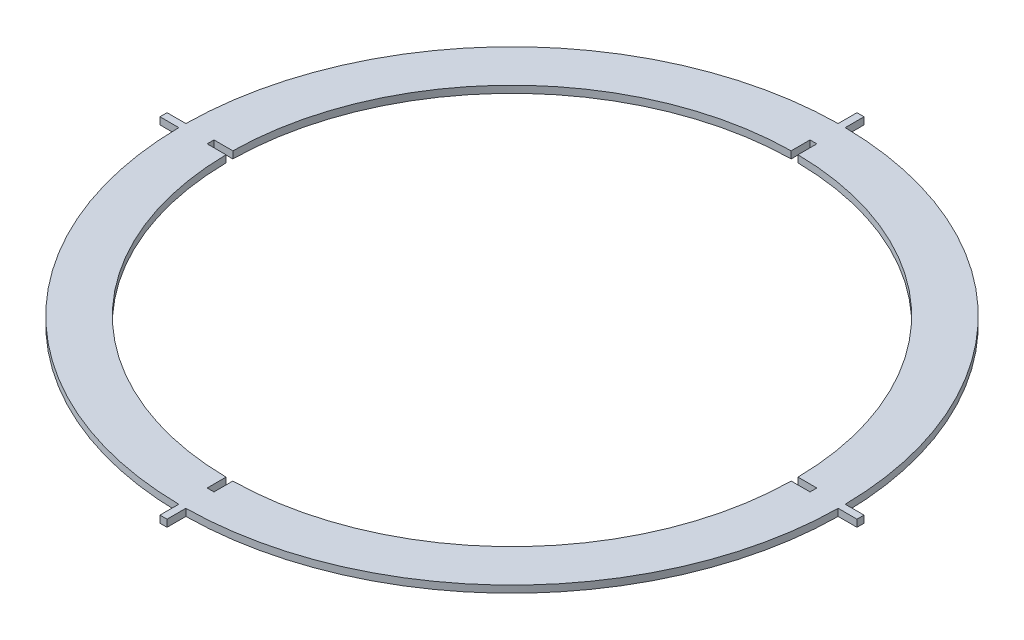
from build123d import *

# Parameters (mm, degrees)
BOSS_EXTRUDE1_DEPTH = 3


with BuildPart() as part:
    # Sketch1 → Boss-Extrude1 (new body)
    with BuildSketch(Plane(origin=(0, 0, 0), x_dir=(1, 0, 0), z_dir=(0, 1, 0))):
        with BuildLine():
            Line((-147.991964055, 1.5), (-139.991964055, 1.5))
            ThreePointArc((-139.991964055, 1.5), (-98.994949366, 98.994949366), (-1.5, 139.991964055))
            Line((-1.5, 139.991964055), (-1.5, 147.991964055))
            Line((-1.5, 147.991964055), (1.5, 147.991964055))
            Line((1.5, 147.991964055), (1.5, 139.991964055))
            ThreePointArc((1.5, 139.991964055), (98.994949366, 98.994949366), (139.991964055, 1.5))
            Line((139.991964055, 1.5), (147.991964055, 1.5))
            Line((147.991964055, 1.5), (147.991964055, -1.5))
            Line((147.991964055, -1.5), (139.991964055, -1.5))
            ThreePointArc((139.991964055, -1.5), (98.994949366, -98.994949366), (1.5, -139.991964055))
            Line((1.5, -139.991964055), (1.5, -147.991964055))
            Line((1.5, -147.991964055), (-1.5, -147.991964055))
            Line((-1.5, -147.991964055), (-1.5, -139.991964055))
            ThreePointArc((-1.5, -139.991964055), (-98.994949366, -98.994949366), (-139.991964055, -1.5))
            Line((-139.991964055, -1.5), (-147.991964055, -1.5))
            Line((-147.991964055, -1.5), (-147.991964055, 1.5))
        make_face()
        with BuildLine():
            Line((-127.991239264, -1.45), (-119.991239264, -1.45))
            ThreePointArc((-119.991239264, -1.45), (-84.852813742, -84.852813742), (-1.45, -119.991239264))
            Line((-1.45, -119.991239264), (-1.45, -127.991239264))
            Line((-1.45, -127.991239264), (1.45, -127.991239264))
            Line((1.45, -127.991239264), (1.45, -119.991239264))
            ThreePointArc((1.45, -119.991239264), (84.852813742, -84.852813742), (119.991239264, -1.45))
            Line((119.991239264, -1.45), (127.991239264, -1.45))
            Line((127.991239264, -1.45), (127.991239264, 1.45))
            Line((127.991239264, 1.45), (119.991239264, 1.45))
            ThreePointArc((119.991239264, 1.45), (84.852813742, 84.852813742), (1.45, 119.991239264))
            Line((1.45, 119.991239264), (1.45, 127.991239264))
            Line((1.45, 127.991239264), (-1.45, 127.991239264))
            Line((-1.45, 127.991239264), (-1.45, 119.991239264))
            ThreePointArc((-1.45, 119.991239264), (-84.852813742, 84.852813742), (-119.991239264, 1.45))
            Line((-119.991239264, 1.45), (-127.991239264, 1.45))
            Line((-127.991239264, 1.45), (-127.991239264, -1.45))
        make_face(mode=Mode.SUBTRACT)
    extrude(amount=BOSS_EXTRUDE1_DEPTH)


solid = part.part
